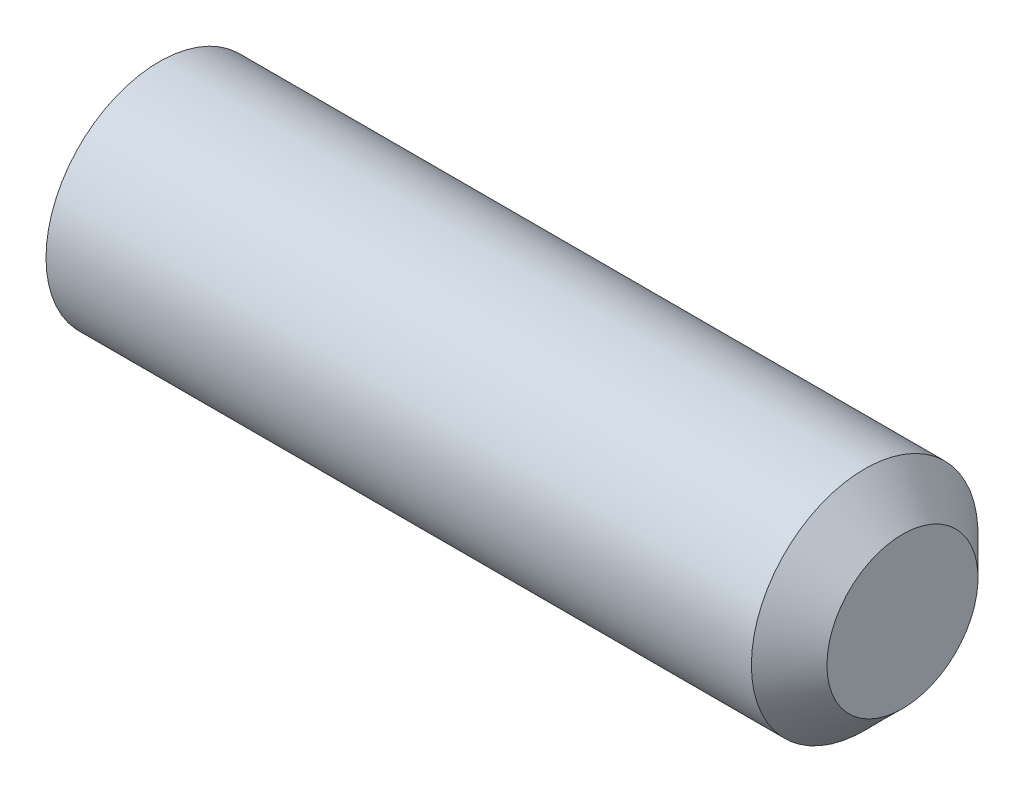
ISO-10303-21;
HEADER;
FILE_DESCRIPTION(('STEP AP214'),'2;1');
FILE_NAME('part.step','',(''),(''),'','','');
FILE_SCHEMA(('AUTOMOTIVE_DESIGN { 1 0 10303 214 1 1 1 1 }'));
ENDSEC;
DATA;
#1=APPLICATION_CONTEXT('core data for automotive mechanical design processes');
#2=APPLICATION_PROTOCOL_DEFINITION('international standard','automotive_design',2000,#1);
#3=PRODUCT_CONTEXT('',#1,'mechanical');
#4=PRODUCT('Part','Part','',(#3));
#5=PRODUCT_RELATED_PRODUCT_CATEGORY('part','',(#4));
#6=PRODUCT_DEFINITION_FORMATION('','',#4);
#7=PRODUCT_DEFINITION_CONTEXT('part definition',#1,'design');
#8=PRODUCT_DEFINITION('design','',#6,#7);
#9=PRODUCT_DEFINITION_SHAPE('','',#8);
#10=(LENGTH_UNIT() NAMED_UNIT(*) SI_UNIT(.MILLI.,.METRE.));
#11=(NAMED_UNIT(*) PLANE_ANGLE_UNIT() SI_UNIT($,.RADIAN.));
#12=(NAMED_UNIT(*) SI_UNIT($,.STERADIAN.) SOLID_ANGLE_UNIT());
#13=UNCERTAINTY_MEASURE_WITH_UNIT(LENGTH_MEASURE(1.E-05),#10,'distance_accuracy_value','');
#14=(GEOMETRIC_REPRESENTATION_CONTEXT(3) GLOBAL_UNCERTAINTY_ASSIGNED_CONTEXT((#13)) GLOBAL_UNIT_ASSIGNED_CONTEXT((#10,
#11,#12)) REPRESENTATION_CONTEXT('',''));
#15=CARTESIAN_POINT('',(0.,0.,0.));
#16=DIRECTION('',(0.,0.,1.));
#17=DIRECTION('',(1.,0.,0.));
#18=AXIS2_PLACEMENT_3D('',#15,#16,#17);
#19=CARTESIAN_POINT('',(0.,0.,0.));
#20=DIRECTION('',(-1.,0.,0.));
#21=DIRECTION('',(0.,0.,1.));
#22=AXIS2_PLACEMENT_3D('',#19,#20,#21);
#23=PLANE('',#22);
#24=CARTESIAN_POINT('',(0.,0.,0.));
#25=DIRECTION('',(-1.,0.,0.));
#26=DIRECTION('',(0.,0.,1.));
#27=AXIS2_PLACEMENT_3D('',#24,#25,#26);
#28=CIRCLE('',#27,1.2195);
#29=CARTESIAN_POINT('',(0.,0.,1.2195));
#30=VERTEX_POINT('',#29);
#31=EDGE_CURVE('E134',#30,#30,#28,.T.);
#32=ORIENTED_EDGE('',*,*,#31,.T.);
#33=EDGE_LOOP('',(#32));
#34=FACE_BOUND('',#33,.T.);
#35=DIRECTION('',(0.,0.,-1.));
#36=VECTOR('',#35,1.);
#37=CARTESIAN_POINT('',(0.,0.750000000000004,0.433012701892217));
#38=LINE('',#37,#36);
#39=CARTESIAN_POINT('',(0.,0.750000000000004,0.433012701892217));
#40=VERTEX_POINT('',#39);
#41=CARTESIAN_POINT('',(0.,0.750000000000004,-0.433012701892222));
#42=VERTEX_POINT('',#41);
#43=EDGE_CURVE('E125',#40,#42,#38,.T.);
#44=ORIENTED_EDGE('',*,*,#43,.F.);
#45=DIRECTION('',(0.,-0.866025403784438,0.5));
#46=VECTOR('',#45,1.);
#47=CARTESIAN_POINT('',(0.,0.750000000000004,0.433012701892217));
#48=LINE('',#47,#46);
#49=CARTESIAN_POINT('',(0.,0.,0.866025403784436));
#50=VERTEX_POINT('',#49);
#51=EDGE_CURVE('E47',#40,#50,#48,.T.);
#52=ORIENTED_EDGE('',*,*,#51,.T.);
#53=DIRECTION('',(0.,0.866025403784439,0.5));
#54=VECTOR('',#53,1.);
#55=CARTESIAN_POINT('',(0.,-0.749999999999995,0.433012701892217));
#56=LINE('',#55,#54);
#57=CARTESIAN_POINT('',(0.,-0.749999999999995,0.433012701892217));
#58=VERTEX_POINT('',#57);
#59=EDGE_CURVE('E116',#58,#50,#56,.T.);
#60=ORIENTED_EDGE('',*,*,#59,.F.);
#61=DIRECTION('',(0.,0.,-1.));
#62=VECTOR('',#61,1.);
#63=CARTESIAN_POINT('',(0.,-0.749999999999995,0.433012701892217));
#64=LINE('',#63,#62);
#65=CARTESIAN_POINT('',(0.,-0.749999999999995,-0.433012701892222));
#66=VERTEX_POINT('',#65);
#67=EDGE_CURVE('E119',#58,#66,#64,.T.);
#68=ORIENTED_EDGE('',*,*,#67,.T.);
#69=DIRECTION('',(0.,0.866025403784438,-0.500000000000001));
#70=VECTOR('',#69,1.);
#71=CARTESIAN_POINT('',(0.,-0.749999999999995,-0.433012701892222));
#72=LINE('',#71,#70);
#73=CARTESIAN_POINT('',(0.,0.,-0.866025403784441));
#74=VERTEX_POINT('',#73);
#75=EDGE_CURVE('E122',#66,#74,#72,.T.);
#76=ORIENTED_EDGE('',*,*,#75,.T.);
#77=DIRECTION('',(0.,-0.866025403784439,-0.5));
#78=VECTOR('',#77,1.);
#79=CARTESIAN_POINT('',(0.,0.750000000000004,-0.433012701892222));
#80=LINE('',#79,#78);
#81=EDGE_CURVE('E105',#42,#74,#80,.T.);
#82=ORIENTED_EDGE('',*,*,#81,.F.);
#83=EDGE_LOOP('',(#44,#52,#60,#68,#76,#82));
#84=FACE_BOUND('',#83,.T.);
#85=ADVANCED_FACE('F32',(#34,#84),#23,.T.);
#86=CARTESIAN_POINT('',(9.99999999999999,1.,0.));
#87=DIRECTION('',(1.,0.,0.));
#88=DIRECTION('',(0.,0.,-1.));
#89=AXIS2_PLACEMENT_3D('',#86,#87,#88);
#90=PLANE('',#89);
#91=CARTESIAN_POINT('',(9.99999999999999,0.,0.));
#92=DIRECTION('',(-1.,0.,0.));
#93=DIRECTION('',(0.,0.,1.));
#94=AXIS2_PLACEMENT_3D('',#91,#92,#93);
#95=CIRCLE('',#94,1.);
#96=CARTESIAN_POINT('',(9.99999999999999,0.,1.));
#97=VERTEX_POINT('',#96);
#98=EDGE_CURVE('E11',#97,#97,#95,.T.);
#99=ORIENTED_EDGE('',*,*,#98,.F.);
#100=EDGE_LOOP('',(#99));
#101=FACE_BOUND('',#100,.T.);
#102=ADVANCED_FACE('F34',(#101),#90,.T.);
#103=CARTESIAN_POINT('',(9.50000000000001,0.,0.));
#104=DIRECTION('',(-1.,0.,0.));
#105=DIRECTION('',(0.,0.,1.));
#106=AXIS2_PLACEMENT_3D('',#103,#104,#105);
#107=CONICAL_SURFACE('',#106,1.5,0.785398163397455);
#108=ORIENTED_EDGE('',*,*,#98,.T.);
#109=EDGE_LOOP('',(#108));
#110=FACE_BOUND('',#109,.T.);
#111=CARTESIAN_POINT('',(9.50000000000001,0.,0.));
#112=DIRECTION('',(-1.,0.,0.));
#113=DIRECTION('',(0.,0.,1.));
#114=AXIS2_PLACEMENT_3D('',#111,#112,#113);
#115=CIRCLE('',#114,1.5);
#116=CARTESIAN_POINT('',(9.50000000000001,0.,1.5));
#117=VERTEX_POINT('',#116);
#118=EDGE_CURVE('E40',#117,#117,#115,.T.);
#119=ORIENTED_EDGE('',*,*,#118,.F.);
#120=EDGE_LOOP('',(#119));
#121=FACE_BOUND('',#120,.T.);
#122=ADVANCED_FACE('F145',(#110,#121),#107,.T.);
#123=CARTESIAN_POINT('',(-12.7,0.,0.));
#124=DIRECTION('',(-1.,0.,0.));
#125=DIRECTION('',(0.,0.,1.));
#126=AXIS2_PLACEMENT_3D('',#123,#124,#125);
#127=CYLINDRICAL_SURFACE('',#126,1.5);
#128=ORIENTED_EDGE('',*,*,#118,.T.);
#129=EDGE_LOOP('',(#128));
#130=FACE_BOUND('',#129,.T.);
#131=CARTESIAN_POINT('',(0.161946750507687,0.,0.));
#132=DIRECTION('',(-1.,0.,0.));
#133=DIRECTION('',(0.,0.,1.));
#134=AXIS2_PLACEMENT_3D('',#131,#132,#133);
#135=CIRCLE('',#134,1.5);
#136=CARTESIAN_POINT('',(0.161946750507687,0.,1.5));
#137=VERTEX_POINT('',#136);
#138=EDGE_CURVE('E137',#137,#137,#135,.T.);
#139=ORIENTED_EDGE('',*,*,#138,.F.);
#140=EDGE_LOOP('',(#139));
#141=FACE_BOUND('',#140,.T.);
#142=ADVANCED_FACE('F142',(#130,#141),#127,.T.);
#143=CARTESIAN_POINT('',(0.,0.,0.));
#144=DIRECTION('',(1.,0.,0.));
#145=DIRECTION('',(0.,0.,-1.));
#146=AXIS2_PLACEMENT_3D('',#143,#144,#145);
#147=CONICAL_SURFACE('',#146,1.2195,1.0471975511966);
#148=ORIENTED_EDGE('',*,*,#138,.T.);
#149=EDGE_LOOP('',(#148));
#150=FACE_BOUND('',#149,.T.);
#151=ORIENTED_EDGE('',*,*,#31,.F.);
#152=EDGE_LOOP('',(#151));
#153=FACE_BOUND('',#152,.T.);
#154=ADVANCED_FACE('F152',(#150,#153),#147,.T.);
#155=CARTESIAN_POINT('',(1.2,0.750000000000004,0.433012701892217));
#156=DIRECTION('',(0.,-0.5,-0.866025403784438));
#157=DIRECTION('',(0.,0.866025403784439,-0.5));
#158=AXIS2_PLACEMENT_3D('',#155,#156,#157);
#159=PLANE('',#158);
#160=ORIENTED_EDGE('',*,*,#51,.F.);
#161=DIRECTION('',(-1.,0.,0.));
#162=VECTOR('',#161,1.);
#163=CARTESIAN_POINT('',(1.2,0.750000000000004,0.433012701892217));
#164=LINE('',#163,#162);
#165=CARTESIAN_POINT('',(1.2,0.750000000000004,0.433012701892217));
#166=VERTEX_POINT('',#165);
#167=EDGE_CURVE('E52',#166,#40,#164,.T.);
#168=ORIENTED_EDGE('',*,*,#167,.F.);
#169=DIRECTION('',(0.,-0.866025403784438,0.5));
#170=VECTOR('',#169,1.);
#171=CARTESIAN_POINT('',(1.2,0.750000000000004,0.433012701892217));
#172=LINE('',#171,#170);
#173=CARTESIAN_POINT('',(1.2,0.,0.866025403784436));
#174=VERTEX_POINT('',#173);
#175=EDGE_CURVE('E79',#166,#174,#172,.T.);
#176=ORIENTED_EDGE('',*,*,#175,.T.);
#177=DIRECTION('',(-1.,0.,0.));
#178=VECTOR('',#177,1.);
#179=CARTESIAN_POINT('',(1.2,0.,0.866025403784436));
#180=LINE('',#179,#178);
#181=EDGE_CURVE('E132',#174,#50,#180,.T.);
#182=ORIENTED_EDGE('',*,*,#181,.T.);
#183=EDGE_LOOP('',(#160,#168,#176,#182));
#184=FACE_BOUND('',#183,.T.);
#185=ADVANCED_FACE('F163',(#184),#159,.T.);
#186=CARTESIAN_POINT('',(1.2,-0.749999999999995,0.433012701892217));
#187=DIRECTION('',(0.,-0.5,0.866025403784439));
#188=DIRECTION('',(0.,-0.866025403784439,-0.5));
#189=AXIS2_PLACEMENT_3D('',#186,#187,#188);
#190=PLANE('',#189);
#191=ORIENTED_EDGE('',*,*,#59,.T.);
#192=ORIENTED_EDGE('',*,*,#181,.F.);
#193=DIRECTION('',(0.,0.866025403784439,0.5));
#194=VECTOR('',#193,1.);
#195=CARTESIAN_POINT('',(1.2,-0.749999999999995,0.433012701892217));
#196=LINE('',#195,#194);
#197=CARTESIAN_POINT('',(1.2,-0.749999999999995,0.433012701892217));
#198=VERTEX_POINT('',#197);
#199=EDGE_CURVE('E261',#198,#174,#196,.T.);
#200=ORIENTED_EDGE('',*,*,#199,.F.);
#201=DIRECTION('',(-1.,0.,0.));
#202=VECTOR('',#201,1.);
#203=CARTESIAN_POINT('',(1.2,-0.749999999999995,0.433012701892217));
#204=LINE('',#203,#202);
#205=EDGE_CURVE('E130',#198,#58,#204,.T.);
#206=ORIENTED_EDGE('',*,*,#205,.T.);
#207=EDGE_LOOP('',(#191,#192,#200,#206));
#208=FACE_BOUND('',#207,.T.);
#209=ADVANCED_FACE('F170',(#208),#190,.F.);
#210=CARTESIAN_POINT('',(1.2,-0.749999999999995,0.433012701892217));
#211=DIRECTION('',(0.,1.,0.));
#212=DIRECTION('',(0.,0.,1.));
#213=AXIS2_PLACEMENT_3D('',#210,#211,#212);
#214=PLANE('',#213);
#215=ORIENTED_EDGE('',*,*,#67,.F.);
#216=ORIENTED_EDGE('',*,*,#205,.F.);
#217=DIRECTION('',(0.,0.,-1.));
#218=VECTOR('',#217,1.);
#219=CARTESIAN_POINT('',(1.2,-0.749999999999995,0.433012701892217));
#220=LINE('',#219,#218);
#221=CARTESIAN_POINT('',(1.2,-0.749999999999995,-0.433012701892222));
#222=VERTEX_POINT('',#221);
#223=EDGE_CURVE('E100',#198,#222,#220,.T.);
#224=ORIENTED_EDGE('',*,*,#223,.T.);
#225=DIRECTION('',(-1.,0.,0.));
#226=VECTOR('',#225,1.);
#227=CARTESIAN_POINT('',(1.2,-0.749999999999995,-0.433012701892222));
#228=LINE('',#227,#226);
#229=EDGE_CURVE('E95',#222,#66,#228,.T.);
#230=ORIENTED_EDGE('',*,*,#229,.T.);
#231=EDGE_LOOP('',(#215,#216,#224,#230));
#232=FACE_BOUND('',#231,.T.);
#233=ADVANCED_FACE('F177',(#232),#214,.T.);
#234=CARTESIAN_POINT('',(1.2,-0.749999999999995,-0.433012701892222));
#235=DIRECTION('',(0.,0.500000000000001,0.866025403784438));
#236=DIRECTION('',(0.,-0.866025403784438,0.500000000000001));
#237=AXIS2_PLACEMENT_3D('',#234,#235,#236);
#238=PLANE('',#237);
#239=ORIENTED_EDGE('',*,*,#75,.F.);
#240=ORIENTED_EDGE('',*,*,#229,.F.);
#241=DIRECTION('',(0.,0.866025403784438,-0.500000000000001));
#242=VECTOR('',#241,1.);
#243=CARTESIAN_POINT('',(1.2,-0.749999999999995,-0.433012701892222));
#244=LINE('',#243,#242);
#245=CARTESIAN_POINT('',(1.2,0.,-0.866025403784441));
#246=VERTEX_POINT('',#245);
#247=EDGE_CURVE('E90',#222,#246,#244,.T.);
#248=ORIENTED_EDGE('',*,*,#247,.T.);
#249=DIRECTION('',(-1.,0.,0.));
#250=VECTOR('',#249,1.);
#251=CARTESIAN_POINT('',(1.2,0.,-0.866025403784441));
#252=LINE('',#251,#250);
#253=EDGE_CURVE('E94',#246,#74,#252,.T.);
#254=ORIENTED_EDGE('',*,*,#253,.T.);
#255=EDGE_LOOP('',(#239,#240,#248,#254));
#256=FACE_BOUND('',#255,.T.);
#257=ADVANCED_FACE('F93',(#256),#238,.T.);
#258=CARTESIAN_POINT('',(1.2,0.750000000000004,-0.433012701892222));
#259=DIRECTION('',(0.,0.5,-0.866025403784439));
#260=DIRECTION('',(0.,0.866025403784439,0.5));
#261=AXIS2_PLACEMENT_3D('',#258,#259,#260);
#262=PLANE('',#261);
#263=ORIENTED_EDGE('',*,*,#81,.T.);
#264=ORIENTED_EDGE('',*,*,#253,.F.);
#265=DIRECTION('',(0.,-0.866025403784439,-0.5));
#266=VECTOR('',#265,1.);
#267=CARTESIAN_POINT('',(1.2,0.750000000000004,-0.433012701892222));
#268=LINE('',#267,#266);
#269=CARTESIAN_POINT('',(1.2,0.750000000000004,-0.433012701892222));
#270=VERTEX_POINT('',#269);
#271=EDGE_CURVE('E99',#270,#246,#268,.T.);
#272=ORIENTED_EDGE('',*,*,#271,.F.);
#273=DIRECTION('',(-1.,0.,0.));
#274=VECTOR('',#273,1.);
#275=CARTESIAN_POINT('',(1.2,0.750000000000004,-0.433012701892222));
#276=LINE('',#275,#274);
#277=EDGE_CURVE('E75',#270,#42,#276,.T.);
#278=ORIENTED_EDGE('',*,*,#277,.T.);
#279=EDGE_LOOP('',(#263,#264,#272,#278));
#280=FACE_BOUND('',#279,.T.);
#281=ADVANCED_FACE('F102',(#280),#262,.F.);
#282=CARTESIAN_POINT('',(1.2,0.750000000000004,0.433012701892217));
#283=DIRECTION('',(0.,1.,0.));
#284=DIRECTION('',(0.,0.,1.));
#285=AXIS2_PLACEMENT_3D('',#282,#283,#284);
#286=PLANE('',#285);
#287=ORIENTED_EDGE('',*,*,#43,.T.);
#288=ORIENTED_EDGE('',*,*,#277,.F.);
#289=DIRECTION('',(0.,0.,-1.));
#290=VECTOR('',#289,1.);
#291=CARTESIAN_POINT('',(1.2,0.750000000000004,0.433012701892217));
#292=LINE('',#291,#290);
#293=EDGE_CURVE('E110',#166,#270,#292,.T.);
#294=ORIENTED_EDGE('',*,*,#293,.F.);
#295=ORIENTED_EDGE('',*,*,#167,.T.);
#296=EDGE_LOOP('',(#287,#288,#294,#295));
#297=FACE_BOUND('',#296,.T.);
#298=ADVANCED_FACE('F189',(#297),#286,.F.);
#299=CARTESIAN_POINT('',(1.2,1.5,0.));
#300=DIRECTION('',(1.,0.,0.));
#301=DIRECTION('',(0.,0.,-1.));
#302=AXIS2_PLACEMENT_3D('',#299,#300,#301);
#303=PLANE('',#302);
#304=ORIENTED_EDGE('',*,*,#175,.F.);
#305=ORIENTED_EDGE('',*,*,#293,.T.);
#306=ORIENTED_EDGE('',*,*,#271,.T.);
#307=ORIENTED_EDGE('',*,*,#247,.F.);
#308=ORIENTED_EDGE('',*,*,#223,.F.);
#309=ORIENTED_EDGE('',*,*,#199,.T.);
#310=EDGE_LOOP('',(#304,#305,#306,#307,#308,#309));
#311=FACE_BOUND('',#310,.T.);
#312=ADVANCED_FACE('F108',(#311),#303,.F.);
#313=CLOSED_SHELL('',(#85,#102,#122,#142,#154,#185,#209,#233,#257,#281,#298,#312));
#314=MANIFOLD_SOLID_BREP('B2',#313);
#315=ADVANCED_BREP_SHAPE_REPRESENTATION('',(#18,#314),#14);
#316=SHAPE_DEFINITION_REPRESENTATION(#9,#315);
ENDSEC;
END-ISO-10303-21;
